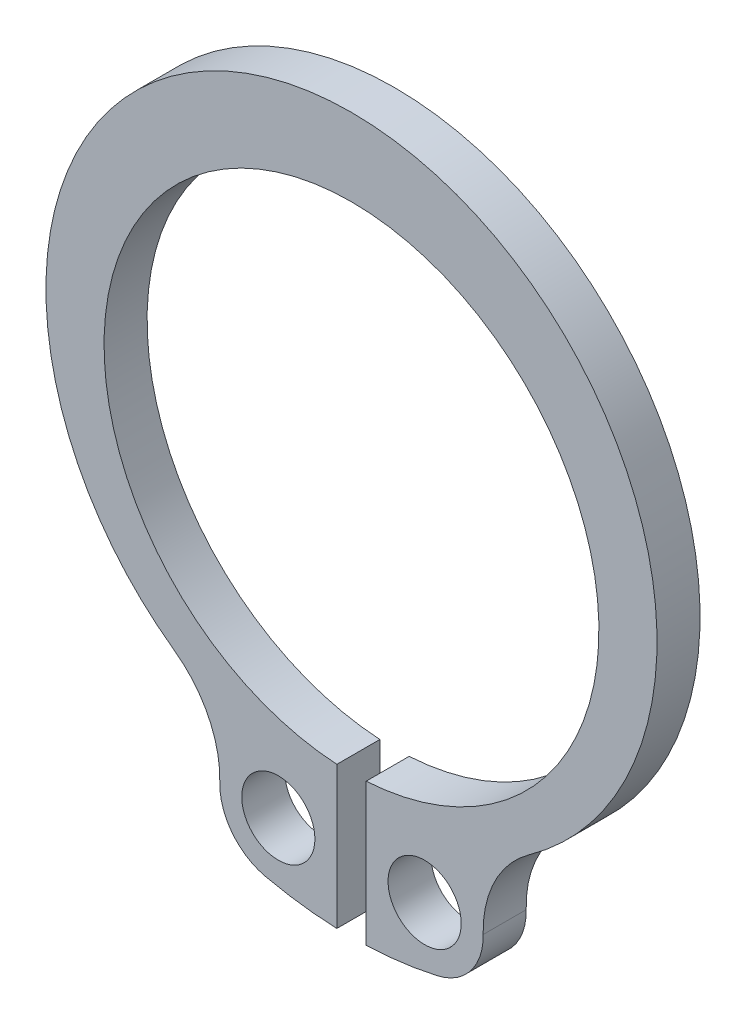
from build123d import *

# Parameters (mm, degrees)
ESQUISSE1_R      = 0.85
EXTRUSION1_DEPTH = 1


with BuildPart() as part:
    # Esquisse1 → Extrusion1 (new body)
    with BuildSketch(Plane.XY):
        with BuildLine():
            Line((0.34, -5.739939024), (0.34, -9.043864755))
            ThreePointArc((0.34, -9.043864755), (1.175362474, -8.973606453), (2.000640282, -8.826354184))
            ThreePointArc((2.000640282, -8.826354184), (2.773139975, -8.335446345), (3.059578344, -7.466136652))
            ThreePointArc((3.059578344, -7.466136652), (3.327069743, -6.264107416), (4.126672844, -5.327592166))
            ThreePointArc((4.126672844, -5.327592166), (0, 7.55), (-4.126672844, -5.327592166))
            ThreePointArc((-4.126672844, -5.327592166), (-3.327069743, -6.264107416), (-3.059578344, -7.466136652))
            ThreePointArc((-3.059578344, -7.466136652), (-2.773139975, -8.335446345), (-2.000640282, -8.826354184))
            ThreePointArc((-2.000640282, -8.826354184), (-1.175362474, -8.973606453), (-0.34, -9.043864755))
            Line((-0.34, -9.043864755), (-0.34, -5.739939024))
            ThreePointArc((-0.34, -5.739939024), (0, 5.75), (0.34, -5.739939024))
        make_face()
        with Locations((1.7, -7.5)):
            Circle(ESQUISSE1_R, mode=Mode.SUBTRACT)
        with Locations((-1.7, -7.5)):
            Circle(ESQUISSE1_R, mode=Mode.SUBTRACT)
    extrude(amount=EXTRUSION1_DEPTH)


solid = part.part
